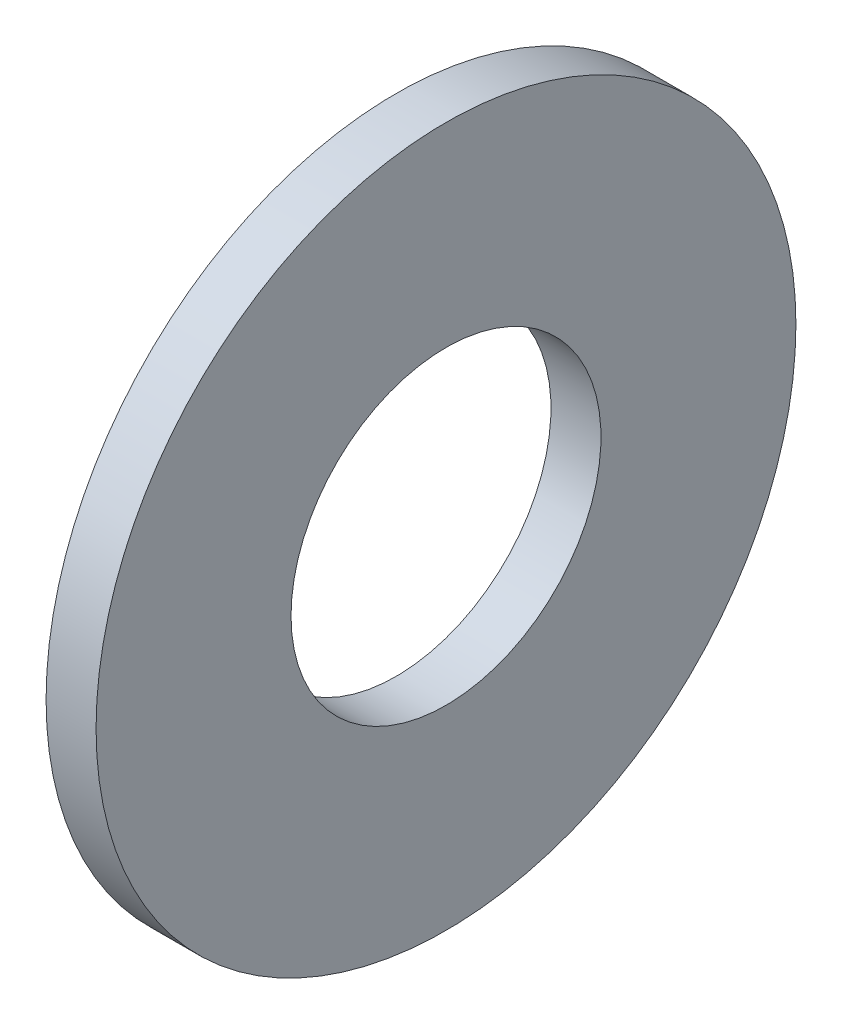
from build123d import *

# Parameters (mm, degrees)
ESQUISSE1_W = 1
ESQUISSE1_H = 3.9


with BuildPart() as part:
    # Esquisse1 → R_volution1 (revolve)
    with BuildSketch(Plane.XY, mode=Mode.PRIVATE) as r_volution1_sk:
        with Locations((0.5, 5.05)):
            Rectangle(ESQUISSE1_W, ESQUISSE1_H)
    revolve(r_volution1_sk.sketch.rotate(Axis((-33.380560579, 0, 0), (1, 0, 0)), 90), axis=Axis((-33.380560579, 0, 0), (1, 0, 0)))


solid = part.part
